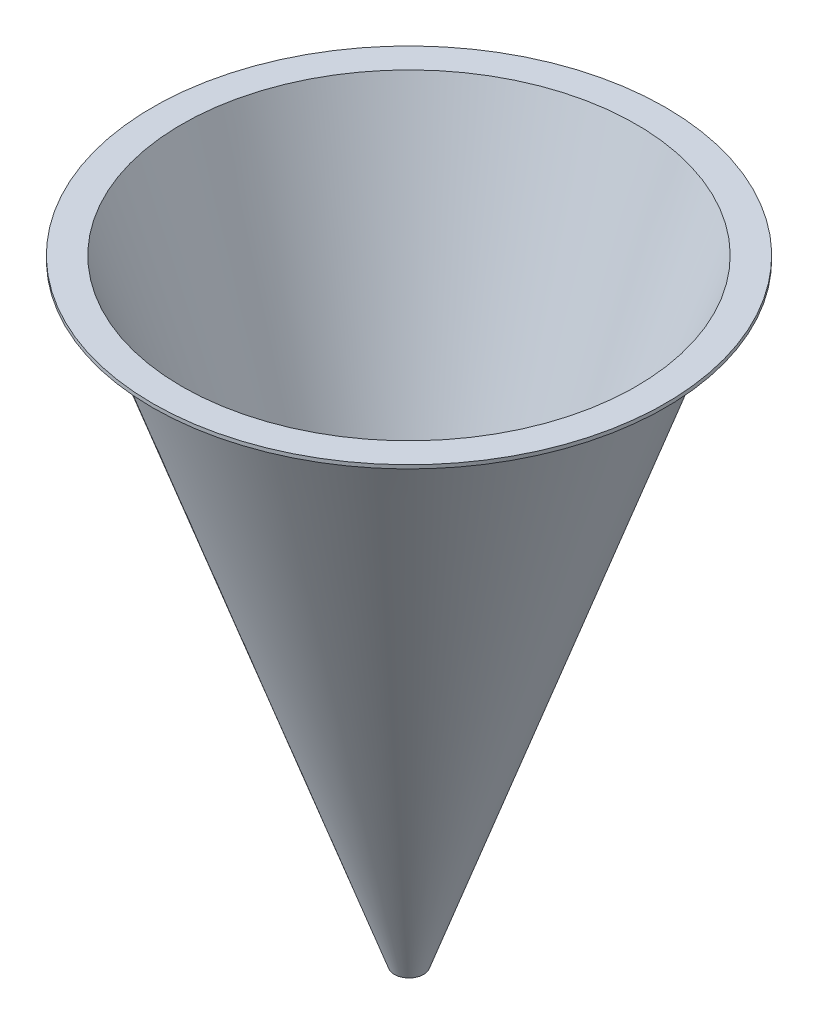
from build123d import *


with BuildPart() as part:
    # Sketch2 → Base-Revolve (revolve)
    with BuildSketch(Plane.XY, mode=Mode.PRIVATE) as base_revolve_sk:
        Polygon((444.5, 0), (393.7, 0), (18.993460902, -1066.8), (25.4, -1066.8), (400.05, -6.35), (444.5, -6.35), align=None)
    revolve(base_revolve_sk.sketch.rotate(Axis((0, 69.399866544, 0), (0, -1, 0)), 90), axis=Axis((0, 69.399866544, 0), (0, -1, 0)))


solid = part.part
